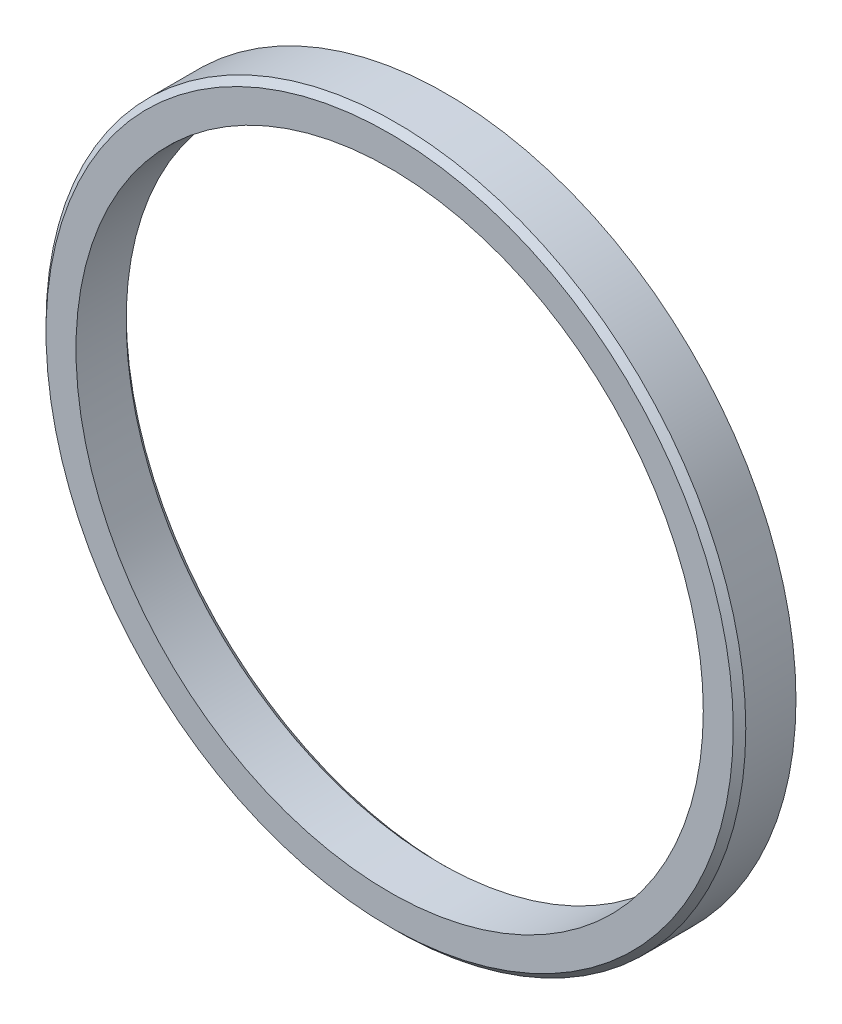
ISO-10303-21;
HEADER;
FILE_DESCRIPTION(('STEP AP214'),'2;1');
FILE_NAME('part.step','',(''),(''),'','','');
FILE_SCHEMA(('AUTOMOTIVE_DESIGN { 1 0 10303 214 1 1 1 1 }'));
ENDSEC;
DATA;
#1=APPLICATION_CONTEXT('core data for automotive mechanical design processes');
#2=APPLICATION_PROTOCOL_DEFINITION('international standard','automotive_design',2000,#1);
#3=PRODUCT_CONTEXT('',#1,'mechanical');
#4=PRODUCT('Part','Part','',(#3));
#5=PRODUCT_RELATED_PRODUCT_CATEGORY('part','',(#4));
#6=PRODUCT_DEFINITION_FORMATION('','',#4);
#7=PRODUCT_DEFINITION_CONTEXT('part definition',#1,'design');
#8=PRODUCT_DEFINITION('design','',#6,#7);
#9=PRODUCT_DEFINITION_SHAPE('','',#8);
#10=(LENGTH_UNIT() NAMED_UNIT(*) SI_UNIT(.MILLI.,.METRE.));
#11=(NAMED_UNIT(*) PLANE_ANGLE_UNIT() SI_UNIT($,.RADIAN.));
#12=(NAMED_UNIT(*) SI_UNIT($,.STERADIAN.) SOLID_ANGLE_UNIT());
#13=UNCERTAINTY_MEASURE_WITH_UNIT(LENGTH_MEASURE(1.E-05),#10,'distance_accuracy_value','');
#14=(GEOMETRIC_REPRESENTATION_CONTEXT(3) GLOBAL_UNCERTAINTY_ASSIGNED_CONTEXT((#13)) GLOBAL_UNIT_ASSIGNED_CONTEXT((#10,
#11,#12)) REPRESENTATION_CONTEXT('',''));
#15=CARTESIAN_POINT('',(0.,0.,0.));
#16=DIRECTION('',(0.,0.,1.));
#17=DIRECTION('',(1.,0.,0.));
#18=AXIS2_PLACEMENT_3D('',#15,#16,#17);
#19=CARTESIAN_POINT('',(0.,109.55,8.00000000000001));
#20=DIRECTION('',(0.,0.,-1.));
#21=DIRECTION('',(-1.,0.,0.));
#22=AXIS2_PLACEMENT_3D('',#19,#20,#21);
#23=PLANE('',#22);
#24=CARTESIAN_POINT('',(0.,0.,8.00000000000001));
#25=DIRECTION('',(0.,0.,1.));
#26=DIRECTION('',(1.,0.,0.));
#27=AXIS2_PLACEMENT_3D('',#24,#25,#26);
#28=CIRCLE('',#27,100.);
#29=CARTESIAN_POINT('',(100.,0.,8.00000000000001));
#30=VERTEX_POINT('',#29);
#31=EDGE_CURVE('E10',#30,#30,#28,.T.);
#32=ORIENTED_EDGE('',*,*,#31,.F.);
#33=EDGE_LOOP('',(#32));
#34=FACE_BOUND('',#33,.T.);
#35=CARTESIAN_POINT('',(0.,0.,8.00000000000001));
#36=DIRECTION('',(0.,0.,1.));
#37=DIRECTION('',(1.,0.,0.));
#38=AXIS2_PLACEMENT_3D('',#35,#36,#37);
#39=CIRCLE('',#38,109.55);
#40=CARTESIAN_POINT('',(109.55,0.,8.00000000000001));
#41=VERTEX_POINT('',#40);
#42=EDGE_CURVE('E55',#41,#41,#39,.T.);
#43=ORIENTED_EDGE('',*,*,#42,.T.);
#44=EDGE_LOOP('',(#43));
#45=FACE_BOUND('',#44,.T.);
#46=ADVANCED_FACE('F33',(#34,#45),#23,.F.);
#47=CARTESIAN_POINT('',(0.,0.,66.6227492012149));
#48=DIRECTION('',(0.,0.,1.));
#49=DIRECTION('',(1.,0.,0.));
#50=AXIS2_PLACEMENT_3D('',#47,#48,#49);
#51=CYLINDRICAL_SURFACE('',#50,100.);
#52=CARTESIAN_POINT('',(0.,0.,-8.00000000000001));
#53=DIRECTION('',(0.,0.,1.));
#54=DIRECTION('',(1.,0.,0.));
#55=AXIS2_PLACEMENT_3D('',#52,#53,#54);
#56=CIRCLE('',#55,100.);
#57=CARTESIAN_POINT('',(100.,0.,-8.00000000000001));
#58=VERTEX_POINT('',#57);
#59=EDGE_CURVE('E39',#58,#58,#56,.T.);
#60=ORIENTED_EDGE('',*,*,#59,.F.);
#61=EDGE_LOOP('',(#60));
#62=FACE_BOUND('',#61,.T.);
#63=ORIENTED_EDGE('',*,*,#31,.T.);
#64=EDGE_LOOP('',(#63));
#65=FACE_BOUND('',#64,.T.);
#66=ADVANCED_FACE('F80',(#62,#65),#51,.F.);
#67=CARTESIAN_POINT('',(0.,0.,-8.00000000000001));
#68=DIRECTION('',(0.,0.,-1.));
#69=DIRECTION('',(-1.,0.,0.));
#70=AXIS2_PLACEMENT_3D('',#67,#68,#69);
#71=CONICAL_SURFACE('',#70,100.,0.785398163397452);
#72=CARTESIAN_POINT('',(0.,0.,-9.99999999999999));
#73=DIRECTION('',(0.,0.,1.));
#74=DIRECTION('',(1.,0.,0.));
#75=AXIS2_PLACEMENT_3D('',#72,#73,#74);
#76=CIRCLE('',#75,102.);
#77=CARTESIAN_POINT('',(102.,0.,-9.99999999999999));
#78=VERTEX_POINT('',#77);
#79=EDGE_CURVE('E43',#78,#78,#76,.T.);
#80=ORIENTED_EDGE('',*,*,#79,.F.);
#81=EDGE_LOOP('',(#80));
#82=FACE_BOUND('',#81,.T.);
#83=ORIENTED_EDGE('',*,*,#59,.T.);
#84=EDGE_LOOP('',(#83));
#85=FACE_BOUND('',#84,.T.);
#86=ADVANCED_FACE('F75',(#82,#85),#71,.F.);
#87=CARTESIAN_POINT('',(0.,102.,-9.99999999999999));
#88=DIRECTION('',(0.,0.,1.));
#89=DIRECTION('',(1.,0.,0.));
#90=AXIS2_PLACEMENT_3D('',#87,#88,#89);
#91=PLANE('',#90);
#92=CARTESIAN_POINT('',(0.,0.,-9.99999999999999));
#93=DIRECTION('',(0.,0.,1.));
#94=DIRECTION('',(1.,0.,0.));
#95=AXIS2_PLACEMENT_3D('',#92,#93,#94);
#96=CIRCLE('',#95,111.55);
#97=CARTESIAN_POINT('',(111.55,0.,-9.99999999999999));
#98=VERTEX_POINT('',#97);
#99=EDGE_CURVE('E47',#98,#98,#96,.T.);
#100=ORIENTED_EDGE('',*,*,#99,.F.);
#101=EDGE_LOOP('',(#100));
#102=FACE_BOUND('',#101,.T.);
#103=ORIENTED_EDGE('',*,*,#79,.T.);
#104=EDGE_LOOP('',(#103));
#105=FACE_BOUND('',#104,.T.);
#106=ADVANCED_FACE('F69',(#102,#105),#91,.F.);
#107=CARTESIAN_POINT('',(0.,0.,66.6227492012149));
#108=DIRECTION('',(0.,0.,1.));
#109=DIRECTION('',(1.,0.,0.));
#110=AXIS2_PLACEMENT_3D('',#107,#108,#109);
#111=CYLINDRICAL_SURFACE('',#110,111.55);
#112=CARTESIAN_POINT('',(0.,0.,6.00000000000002));
#113=DIRECTION('',(0.,0.,1.));
#114=DIRECTION('',(1.,0.,0.));
#115=AXIS2_PLACEMENT_3D('',#112,#113,#114);
#116=CIRCLE('',#115,111.55);
#117=CARTESIAN_POINT('',(111.55,0.,6.00000000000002));
#118=VERTEX_POINT('',#117);
#119=EDGE_CURVE('E52',#118,#118,#116,.T.);
#120=ORIENTED_EDGE('',*,*,#119,.F.);
#121=EDGE_LOOP('',(#120));
#122=FACE_BOUND('',#121,.T.);
#123=ORIENTED_EDGE('',*,*,#99,.T.);
#124=EDGE_LOOP('',(#123));
#125=FACE_BOUND('',#124,.T.);
#126=ADVANCED_FACE('F63',(#122,#125),#111,.T.);
#127=CARTESIAN_POINT('',(0.,0.,6.00000000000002));
#128=DIRECTION('',(0.,0.,-1.));
#129=DIRECTION('',(-1.,0.,0.));
#130=AXIS2_PLACEMENT_3D('',#127,#128,#129);
#131=CONICAL_SURFACE('',#130,111.55,0.785398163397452);
#132=ORIENTED_EDGE('',*,*,#42,.F.);
#133=EDGE_LOOP('',(#132));
#134=FACE_BOUND('',#133,.T.);
#135=ORIENTED_EDGE('',*,*,#119,.T.);
#136=EDGE_LOOP('',(#135));
#137=FACE_BOUND('',#136,.T.);
#138=ADVANCED_FACE('F60',(#134,#137),#131,.T.);
#139=CLOSED_SHELL('',(#46,#66,#86,#106,#126,#138));
#140=MANIFOLD_SOLID_BREP('B2',#139);
#141=ADVANCED_BREP_SHAPE_REPRESENTATION('',(#18,#140),#14);
#142=SHAPE_DEFINITION_REPRESENTATION(#9,#141);
ENDSEC;
END-ISO-10303-21;
